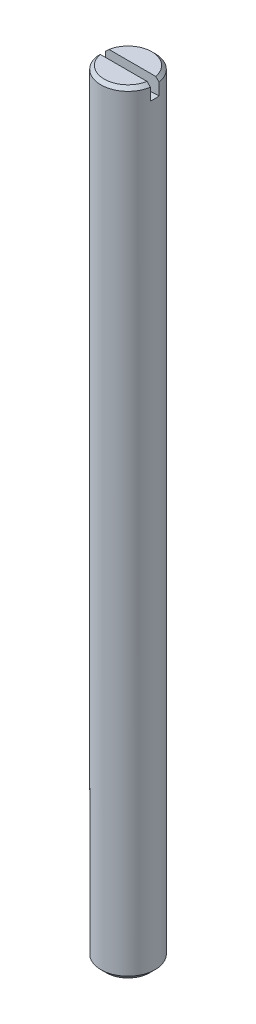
ISO-10303-21;
HEADER;
FILE_DESCRIPTION(('STEP AP214'),'2;1');
FILE_NAME('part.step','',(''),(''),'','','');
FILE_SCHEMA(('AUTOMOTIVE_DESIGN { 1 0 10303 214 1 1 1 1 }'));
ENDSEC;
DATA;
#1=APPLICATION_CONTEXT('core data for automotive mechanical design processes');
#2=APPLICATION_PROTOCOL_DEFINITION('international standard','automotive_design',2000,#1);
#3=PRODUCT_CONTEXT('',#1,'mechanical');
#4=PRODUCT('Part','Part','',(#3));
#5=PRODUCT_RELATED_PRODUCT_CATEGORY('part','',(#4));
#6=PRODUCT_DEFINITION_FORMATION('','',#4);
#7=PRODUCT_DEFINITION_CONTEXT('part definition',#1,'design');
#8=PRODUCT_DEFINITION('design','',#6,#7);
#9=PRODUCT_DEFINITION_SHAPE('','',#8);
#10=(LENGTH_UNIT() NAMED_UNIT(*) SI_UNIT(.MILLI.,.METRE.));
#11=(NAMED_UNIT(*) PLANE_ANGLE_UNIT() SI_UNIT($,.RADIAN.));
#12=(NAMED_UNIT(*) SI_UNIT($,.STERADIAN.) SOLID_ANGLE_UNIT());
#13=UNCERTAINTY_MEASURE_WITH_UNIT(LENGTH_MEASURE(1.E-05),#10,'distance_accuracy_value','');
#14=(GEOMETRIC_REPRESENTATION_CONTEXT(3) GLOBAL_UNCERTAINTY_ASSIGNED_CONTEXT((#13)) GLOBAL_UNIT_ASSIGNED_CONTEXT((#10,
#11,#12)) REPRESENTATION_CONTEXT('',''));
#15=CARTESIAN_POINT('',(0.,0.,0.));
#16=DIRECTION('',(0.,0.,1.));
#17=DIRECTION('',(1.,0.,0.));
#18=AXIS2_PLACEMENT_3D('',#15,#16,#17);
#19=CARTESIAN_POINT('',(0.,41.5,0.));
#20=DIRECTION('',(0.,-1.,0.));
#21=DIRECTION('',(0.,0.,-1.));
#22=AXIS2_PLACEMENT_3D('',#19,#20,#21);
#23=PLANE('',#22);
#24=CARTESIAN_POINT('',(0.,41.499999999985,0.));
#25=DIRECTION('',(0.,-1.,0.));
#26=DIRECTION('',(0.,0.,-1.));
#27=AXIS2_PLACEMENT_3D('',#24,#25,#26);
#28=CIRCLE('',#27,2.19349999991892);
#29=CARTESIAN_POINT('',(-2.1567202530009,41.4999999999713,-0.4));
#30=VERTEX_POINT('',#29);
#31=CARTESIAN_POINT('',(2.1567202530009,41.4999999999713,-0.4));
#32=VERTEX_POINT('',#31);
#33=EDGE_CURVE('E165',#30,#32,#28,.T.);
#34=ORIENTED_EDGE('',*,*,#33,.F.);
#35=DIRECTION('',(1.,0.,0.));
#36=VECTOR('',#35,1.);
#37=CARTESIAN_POINT('',(0.,41.5,-0.4));
#38=LINE('',#37,#36);
#39=EDGE_CURVE('E163',#32,#30,#38,.F.);
#40=ORIENTED_EDGE('',*,*,#39,.F.);
#41=EDGE_LOOP('',(#34,#40));
#42=FACE_BOUND('',#41,.T.);
#43=ADVANCED_FACE('F14',(#42),#23,.F.);
#44=CARTESIAN_POINT('',(0.,41.5,0.));
#45=DIRECTION('',(0.,-1.,0.));
#46=DIRECTION('',(0.,0.,-1.));
#47=AXIS2_PLACEMENT_3D('',#44,#45,#46);
#48=PLANE('',#47);
#49=DIRECTION('',(1.,0.,0.));
#50=VECTOR('',#49,1.);
#51=CARTESIAN_POINT('',(0.,41.5,0.4));
#52=LINE('',#51,#50);
#53=CARTESIAN_POINT('',(-2.1567202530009,41.4999999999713,0.4));
#54=VERTEX_POINT('',#53);
#55=CARTESIAN_POINT('',(2.1567202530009,41.4999999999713,0.4));
#56=VERTEX_POINT('',#55);
#57=EDGE_CURVE('E161',#54,#56,#52,.T.);
#58=ORIENTED_EDGE('',*,*,#57,.F.);
#59=CARTESIAN_POINT('',(0.,41.499999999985,0.));
#60=DIRECTION('',(0.,-1.,0.));
#61=DIRECTION('',(0.,0.,-1.));
#62=AXIS2_PLACEMENT_3D('',#59,#60,#61);
#63=CIRCLE('',#62,2.19349999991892);
#64=EDGE_CURVE('E159',#56,#54,#63,.T.);
#65=ORIENTED_EDGE('',*,*,#64,.F.);
#66=EDGE_LOOP('',(#58,#65));
#67=FACE_BOUND('',#66,.T.);
#68=ADVANCED_FACE('F121',(#67),#48,.F.);
#69=CARTESIAN_POINT('',(0.,41.1934999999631,0.));
#70=DIRECTION('',(0.,-1.,0.));
#71=DIRECTION('',(0.,0.,-1.));
#72=AXIS2_PLACEMENT_3D('',#69,#70,#71);
#73=CONICAL_SURFACE('',#72,2.49999999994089,0.785398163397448);
#74=CARTESIAN_POINT('',(-2.15672025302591,41.4999999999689,-0.400000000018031));
#75=CARTESIAN_POINT('',(-2.20861576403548,41.4489675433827,-0.400000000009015));
#76=CARTESIAN_POINT('',(-2.26048621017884,41.3979096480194,-0.400000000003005));
#77=CARTESIAN_POINT('',(-2.36417697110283,41.2957429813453,-0.399999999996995));
#78=CARTESIAN_POINT('',(-2.41599728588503,41.244634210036,-0.399999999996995));
#79=CARTESIAN_POINT('',(-2.4677925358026,41.1934999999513,-0.4));
#80=B_SPLINE_CURVE_WITH_KNOTS('',3,(#74,#75,#76,#77,#78,#79),.UNSPECIFIED.,.F.,.F.,(4,2,4),(0.,
0.218350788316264,0.436701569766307),.UNSPECIFIED.);
#81=CARTESIAN_POINT('',(-2.46779253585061,41.1934999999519,-0.4));
#82=VERTEX_POINT('',#81);
#83=EDGE_CURVE('E39',#30,#82,#80,.T.);
#84=ORIENTED_EDGE('',*,*,#83,.F.);
#85=ORIENTED_EDGE('',*,*,#33,.T.);
#86=CARTESIAN_POINT('',(2.46779253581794,41.1934999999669,-0.400000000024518));
#87=CARTESIAN_POINT('',(2.41599728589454,41.2446342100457,-0.400000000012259));
#88=CARTESIAN_POINT('',(2.36417697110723,41.2957429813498,-0.400000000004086));
#89=CARTESIAN_POINT('',(2.26048621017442,41.3979096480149,-0.399999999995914));
#90=CARTESIAN_POINT('',(2.20861576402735,41.4489675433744,-0.399999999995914));
#91=CARTESIAN_POINT('',(2.15672025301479,41.4999999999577,-0.4));
#92=B_SPLINE_CURVE_WITH_KNOTS('',3,(#86,#87,#88,#89,#90,#91),.UNSPECIFIED.,.F.,.F.,(4,2,4),(0.,
0.218350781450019,0.436701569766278),.UNSPECIFIED.);
#93=CARTESIAN_POINT('',(2.46779253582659,41.1934999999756,-0.4));
#94=VERTEX_POINT('',#93);
#95=EDGE_CURVE('E134',#94,#32,#92,.T.);
#96=ORIENTED_EDGE('',*,*,#95,.F.);
#97=CARTESIAN_POINT('',(0.,41.1935,0.));
#98=DIRECTION('',(0.,-1.,0.));
#99=DIRECTION('',(0.,0.,-1.));
#100=AXIS2_PLACEMENT_3D('',#97,#98,#99);
#101=CIRCLE('',#100,2.5);
#102=EDGE_CURVE('E9',#82,#94,#101,.T.);
#103=ORIENTED_EDGE('',*,*,#102,.F.);
#104=EDGE_LOOP('',(#84,#85,#96,#103));
#105=FACE_BOUND('',#104,.T.);
#106=ADVANCED_FACE('F116',(#105),#73,.T.);
#107=CARTESIAN_POINT('',(0.,71.5,-0.4));
#108=DIRECTION('',(0.,0.,1.));
#109=DIRECTION('',(1.,0.,0.));
#110=AXIS2_PLACEMENT_3D('',#107,#108,#109);
#111=PLANE('',#110);
#112=ORIENTED_EDGE('',*,*,#39,.T.);
#113=ORIENTED_EDGE('',*,*,#83,.T.);
#114=DIRECTION('',(0.,1.,0.));
#115=VECTOR('',#114,1.);
#116=CARTESIAN_POINT('',(-2.46779253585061,71.5,-0.4));
#117=LINE('',#116,#115);
#118=CARTESIAN_POINT('',(-2.46779253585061,40.096815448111,-0.4));
#119=VERTEX_POINT('',#118);
#120=EDGE_CURVE('E154',#82,#119,#117,.F.);
#121=ORIENTED_EDGE('',*,*,#120,.T.);
#122=CARTESIAN_POINT('',(0.,71.5,-0.4));
#123=DIRECTION('',(0.,0.,-1.));
#124=DIRECTION('',(-1.,0.,0.));
#125=AXIS2_PLACEMENT_3D('',#122,#123,#124);
#126=CIRCLE('',#125,31.5);
#127=CARTESIAN_POINT('',(2.46779253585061,40.096815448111,-0.4));
#128=VERTEX_POINT('',#127);
#129=EDGE_CURVE('E88',#119,#128,#126,.F.);
#130=ORIENTED_EDGE('',*,*,#129,.T.);
#131=DIRECTION('',(0.,1.,0.));
#132=VECTOR('',#131,1.);
#133=CARTESIAN_POINT('',(2.46779253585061,71.5,-0.4));
#134=LINE('',#133,#132);
#135=EDGE_CURVE('E140',#128,#94,#134,.T.);
#136=ORIENTED_EDGE('',*,*,#135,.T.);
#137=ORIENTED_EDGE('',*,*,#95,.T.);
#138=EDGE_LOOP('',(#112,#113,#121,#130,#136,#137));
#139=FACE_BOUND('',#138,.T.);
#140=ADVANCED_FACE('F120',(#139),#111,.T.);
#141=CARTESIAN_POINT('',(0.,41.1934999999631,0.));
#142=DIRECTION('',(0.,-1.,0.));
#143=DIRECTION('',(0.,0.,-1.));
#144=AXIS2_PLACEMENT_3D('',#141,#142,#143);
#145=CONICAL_SURFACE('',#144,2.49999999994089,0.785398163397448);
#146=ORIENTED_EDGE('',*,*,#64,.T.);
#147=CARTESIAN_POINT('',(-2.15672025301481,41.4999999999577,0.4));
#148=CARTESIAN_POINT('',(-2.20861576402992,41.448967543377,0.4));
#149=CARTESIAN_POINT('',(-2.26048621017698,41.3979096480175,0.4));
#150=CARTESIAN_POINT('',(-2.36417697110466,41.2957429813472,0.4));
#151=CARTESIAN_POINT('',(-2.41599728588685,41.2446342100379,0.4));
#152=CARTESIAN_POINT('',(-2.46779253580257,41.1934999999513,0.4));
#153=B_SPLINE_CURVE_WITH_KNOTS('',3,(#147,#148,#149,#150,#151,#152),.UNSPECIFIED.,.F.,.F.,(4,2,
4),(0.,0.218350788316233,0.436701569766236),.UNSPECIFIED.);
#154=CARTESIAN_POINT('',(-2.46779253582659,41.1934999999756,0.4));
#155=VERTEX_POINT('',#154);
#156=EDGE_CURVE('E149',#54,#155,#153,.T.);
#157=ORIENTED_EDGE('',*,*,#156,.T.);
#158=CARTESIAN_POINT('',(0.,41.1935,0.));
#159=DIRECTION('',(0.,-1.,0.));
#160=DIRECTION('',(0.,0.,-1.));
#161=AXIS2_PLACEMENT_3D('',#158,#159,#160);
#162=CIRCLE('',#161,2.5);
#163=CARTESIAN_POINT('',(2.46779253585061,41.1934999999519,0.4));
#164=VERTEX_POINT('',#163);
#165=EDGE_CURVE('E30',#164,#155,#162,.T.);
#166=ORIENTED_EDGE('',*,*,#165,.F.);
#167=CARTESIAN_POINT('',(2.46779253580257,41.1934999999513,0.4));
#168=CARTESIAN_POINT('',(2.41599728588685,41.2446342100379,0.4));
#169=CARTESIAN_POINT('',(2.36417697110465,41.2957429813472,0.4));
#170=CARTESIAN_POINT('',(2.26048621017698,41.3979096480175,0.4));
#171=CARTESIAN_POINT('',(2.20861576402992,41.448967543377,0.4));
#172=CARTESIAN_POINT('',(2.15672025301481,41.4999999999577,0.4));
#173=B_SPLINE_CURVE_WITH_KNOTS('',3,(#167,#168,#169,#170,#171,#172),.UNSPECIFIED.,.F.,.F.,(4,2,
4),(0.,0.21835078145,0.436701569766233),.UNSPECIFIED.);
#174=EDGE_CURVE('E96',#164,#56,#173,.T.);
#175=ORIENTED_EDGE('',*,*,#174,.T.);
#176=EDGE_LOOP('',(#146,#157,#166,#175));
#177=FACE_BOUND('',#176,.T.);
#178=ADVANCED_FACE('F122',(#177),#145,.T.);
#179=CARTESIAN_POINT('',(0.,71.5,0.4));
#180=DIRECTION('',(0.,0.,1.));
#181=DIRECTION('',(1.,0.,0.));
#182=AXIS2_PLACEMENT_3D('',#179,#180,#181);
#183=PLANE('',#182);
#184=ORIENTED_EDGE('',*,*,#57,.T.);
#185=ORIENTED_EDGE('',*,*,#174,.F.);
#186=DIRECTION('',(0.,1.,0.));
#187=VECTOR('',#186,1.);
#188=CARTESIAN_POINT('',(2.46779253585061,71.5,0.4));
#189=LINE('',#188,#187);
#190=CARTESIAN_POINT('',(2.46779253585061,40.096815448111,0.4));
#191=VERTEX_POINT('',#190);
#192=EDGE_CURVE('E94',#191,#164,#189,.T.);
#193=ORIENTED_EDGE('',*,*,#192,.F.);
#194=CARTESIAN_POINT('',(0.,71.5,0.4));
#195=DIRECTION('',(0.,0.,-1.));
#196=DIRECTION('',(-1.,0.,0.));
#197=AXIS2_PLACEMENT_3D('',#194,#195,#196);
#198=CIRCLE('',#197,31.5);
#199=CARTESIAN_POINT('',(-2.46779253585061,40.096815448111,0.4));
#200=VERTEX_POINT('',#199);
#201=EDGE_CURVE('E81',#200,#191,#198,.F.);
#202=ORIENTED_EDGE('',*,*,#201,.F.);
#203=DIRECTION('',(0.,1.,0.));
#204=VECTOR('',#203,1.);
#205=CARTESIAN_POINT('',(-2.46779253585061,71.5,0.4));
#206=LINE('',#205,#204);
#207=EDGE_CURVE('E73',#155,#200,#206,.F.);
#208=ORIENTED_EDGE('',*,*,#207,.F.);
#209=ORIENTED_EDGE('',*,*,#156,.F.);
#210=EDGE_LOOP('',(#184,#185,#193,#202,#208,#209));
#211=FACE_BOUND('',#210,.T.);
#212=ADVANCED_FACE('F92',(#211),#183,.F.);
#213=CARTESIAN_POINT('',(0.,71.5,0.4));
#214=DIRECTION('',(0.,0.,-1.));
#215=DIRECTION('',(-1.,0.,0.));
#216=AXIS2_PLACEMENT_3D('',#213,#214,#215);
#217=CYLINDRICAL_SURFACE('',#216,31.5);
#218=CARTESIAN_POINT('',(2.46779253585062,40.096815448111,-0.4));
#219=CARTESIAN_POINT('',(2.47854531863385,40.0976618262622,-0.333698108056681));
#220=CARTESIAN_POINT('',(2.48661458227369,40.098300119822,-0.266959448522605));
#221=CARTESIAN_POINT('',(2.49732458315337,40.0991493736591,-0.133478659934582));
#222=CARTESIAN_POINT('',(2.5,40.0993630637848,-0.066739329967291));
#223=CARTESIAN_POINT('',(2.5,40.0993630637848,0.066739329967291));
#224=CARTESIAN_POINT('',(2.49732458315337,40.0991493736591,0.133478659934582));
#225=CARTESIAN_POINT('',(2.48661458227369,40.098300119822,0.266959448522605));
#226=CARTESIAN_POINT('',(2.47854531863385,40.0976618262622,0.333698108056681));
#227=CARTESIAN_POINT('',(2.46779253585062,40.096815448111,0.4));
#228=B_SPLINE_CURVE_WITH_KNOTS('',3,(#218,#219,#220,#221,#222,#223,#224,#225,#226,#227),
.UNSPECIFIED.,.F.,.F.,(4,2,2,2,4),(0.,0.201464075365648,0.401628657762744,0.601793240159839,
0.803257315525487),.UNSPECIFIED.);
#229=EDGE_CURVE('E82',#128,#191,#228,.T.);
#230=ORIENTED_EDGE('',*,*,#229,.F.);
#231=ORIENTED_EDGE('',*,*,#129,.F.);
#232=CARTESIAN_POINT('',(-2.46779253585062,40.096815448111,0.4));
#233=CARTESIAN_POINT('',(-2.47854531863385,40.0976618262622,0.333698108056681));
#234=CARTESIAN_POINT('',(-2.48661458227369,40.098300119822,0.266959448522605));
#235=CARTESIAN_POINT('',(-2.49732458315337,40.0991493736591,0.133478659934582));
#236=CARTESIAN_POINT('',(-2.5,40.0993630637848,0.066739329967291));
#237=CARTESIAN_POINT('',(-2.5,40.0993630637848,-0.066739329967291));
#238=CARTESIAN_POINT('',(-2.49732458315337,40.0991493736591,-0.133478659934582));
#239=CARTESIAN_POINT('',(-2.48661458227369,40.098300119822,-0.266959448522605));
#240=CARTESIAN_POINT('',(-2.47854531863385,40.0976618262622,-0.333698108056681));
#241=CARTESIAN_POINT('',(-2.46779253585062,40.096815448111,-0.4));
#242=B_SPLINE_CURVE_WITH_KNOTS('',3,(#232,#233,#234,#235,#236,#237,#238,#239,#240,#241),
.UNSPECIFIED.,.F.,.F.,(4,2,2,2,4),(0.,0.201464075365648,0.401628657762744,0.601793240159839,
0.803257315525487),.UNSPECIFIED.);
#243=EDGE_CURVE('E19',#200,#119,#242,.T.);
#244=ORIENTED_EDGE('',*,*,#243,.F.);
#245=ORIENTED_EDGE('',*,*,#201,.T.);
#246=EDGE_LOOP('',(#230,#231,#244,#245));
#247=FACE_BOUND('',#246,.T.);
#248=ADVANCED_FACE('F16',(#247),#217,.F.);
#249=CARTESIAN_POINT('',(0.,30.,0.));
#250=DIRECTION('',(0.,-1.,0.));
#251=DIRECTION('',(0.,0.,-1.));
#252=AXIS2_PLACEMENT_3D('',#249,#250,#251);
#253=CYLINDRICAL_SURFACE('',#252,2.5);
#254=ORIENTED_EDGE('',*,*,#229,.T.);
#255=ORIENTED_EDGE('',*,*,#192,.T.);
#256=ORIENTED_EDGE('',*,*,#165,.T.);
#257=ORIENTED_EDGE('',*,*,#207,.T.);
#258=ORIENTED_EDGE('',*,*,#243,.T.);
#259=ORIENTED_EDGE('',*,*,#120,.F.);
#260=ORIENTED_EDGE('',*,*,#102,.T.);
#261=ORIENTED_EDGE('',*,*,#135,.F.);
#262=EDGE_LOOP('',(#254,#255,#256,#257,#258,#259,#260,#261));
#263=FACE_BOUND('',#262,.T.);
#264=CARTESIAN_POINT('',(0.,-29.5095,0.));
#265=DIRECTION('',(0.,-1.,0.));
#266=DIRECTION('',(0.,0.,-1.));
#267=AXIS2_PLACEMENT_3D('',#264,#265,#266);
#268=CIRCLE('',#267,2.5);
#269=CARTESIAN_POINT('',(0.,-29.5095,-2.5));
#270=VERTEX_POINT('',#269);
#271=EDGE_CURVE('E172',#270,#270,#268,.F.);
#272=ORIENTED_EDGE('',*,*,#271,.T.);
#273=EDGE_LOOP('',(#272));
#274=FACE_BOUND('',#273,.T.);
#275=ADVANCED_FACE('F75',(#263,#274),#253,.T.);
#276=CARTESIAN_POINT('',(2.0095,-30.,0.));
#277=DIRECTION('',(0.,1.,0.));
#278=DIRECTION('',(0.,0.,1.));
#279=AXIS2_PLACEMENT_3D('',#276,#277,#278);
#280=PLANE('',#279);
#281=CARTESIAN_POINT('',(0.,-30.0000000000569,0.));
#282=DIRECTION('',(0.,1.,0.));
#283=DIRECTION('',(0.,0.,1.));
#284=AXIS2_PLACEMENT_3D('',#281,#282,#283);
#285=CIRCLE('',#284,2.00949999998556);
#286=CARTESIAN_POINT('',(0.,-30.0000000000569,2.00949999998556));
#287=VERTEX_POINT('',#286);
#288=EDGE_CURVE('E90',#287,#287,#285,.T.);
#289=ORIENTED_EDGE('',*,*,#288,.F.);
#290=EDGE_LOOP('',(#289));
#291=FACE_BOUND('',#290,.T.);
#292=ADVANCED_FACE('F113',(#291),#280,.F.);
#293=CARTESIAN_POINT('',(0.,-29.5094999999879,0.));
#294=DIRECTION('',(0.,1.,0.));
#295=DIRECTION('',(0.,0.,1.));
#296=AXIS2_PLACEMENT_3D('',#293,#294,#295);
#297=CONICAL_SURFACE('',#296,2.50000000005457,0.785398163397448);
#298=ORIENTED_EDGE('',*,*,#271,.F.);
#299=EDGE_LOOP('',(#298));
#300=FACE_BOUND('',#299,.T.);
#301=ORIENTED_EDGE('',*,*,#288,.T.);
#302=EDGE_LOOP('',(#301));
#303=FACE_BOUND('',#302,.T.);
#304=ADVANCED_FACE('F114',(#300,#303),#297,.T.);
#305=CLOSED_SHELL('',(#43,#68,#106,#140,#178,#212,#248,#275,#292,#304));
#306=MANIFOLD_SOLID_BREP('B1',#305);
#307=ADVANCED_BREP_SHAPE_REPRESENTATION('',(#18,#306),#14);
#308=SHAPE_DEFINITION_REPRESENTATION(#9,#307);
ENDSEC;
END-ISO-10303-21;
